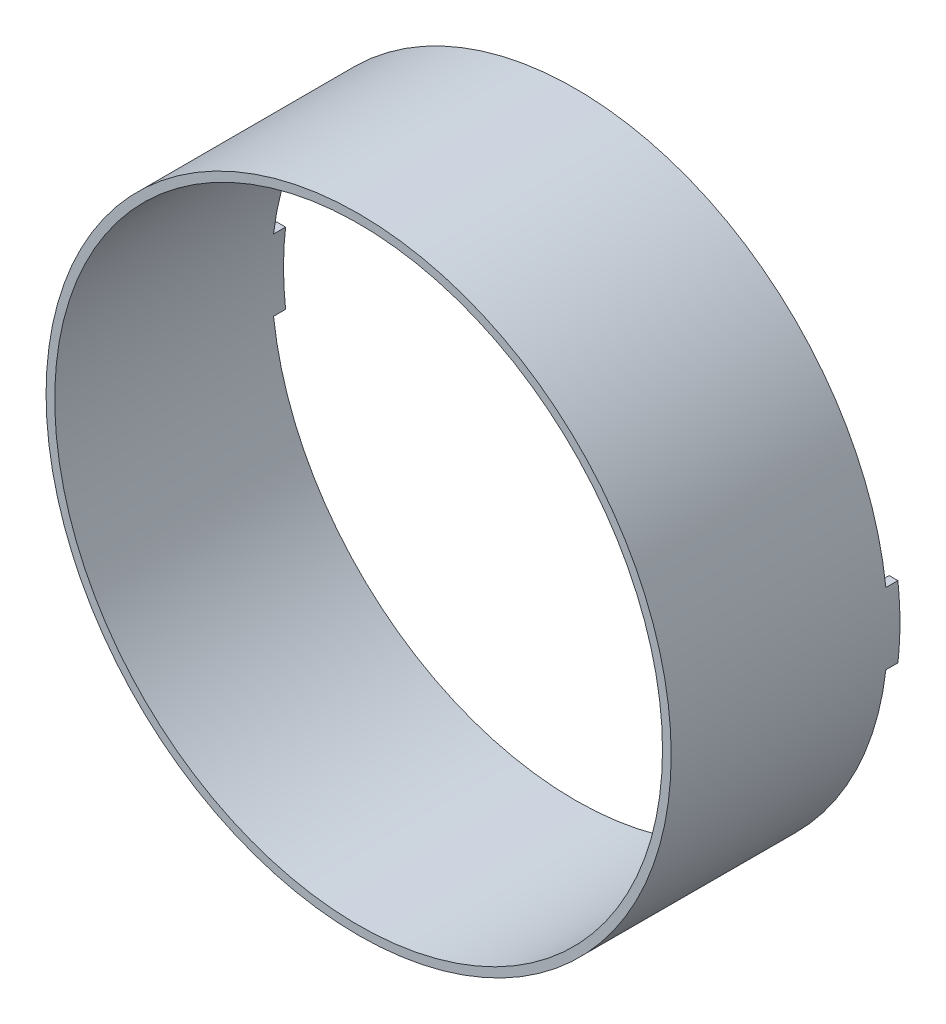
from build123d import *
from build123d.topology import SkipClean

# Parameters (mm, degrees)
BOSS_EXTRUDE1_DEPTH   = 2.5
BOSS_EXTRUDE1_2_DEPTH = 2.5
BOSS_EXTRUDE2_START   = 45
SKETCH3_R             = 64.9
SKETCH3_R_2           = 63.1
BOSS_EXTRUDE2_DEPTH   = 45


with BuildPart() as part:
    # Sketch1 → Boss-Extrude1 (new body)
    with BuildSketch(Plane.XY):
        with BuildLine():
            Line((-64.476739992, 31.755307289), (-62.664583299, 31.755307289))
            ThreePointArc((-62.664583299, 31.755307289), (-63.1, 39.155307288), (-62.664583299, 46.555307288))
            Line((-62.664583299, 46.555307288), (-64.476739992, 46.555307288))
            ThreePointArc((-64.476739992, 46.555307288), (-64.9, 39.155307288), (-64.476739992, 31.755307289))
        make_face()
    extrude(amount=-BOSS_EXTRUDE1_DEPTH)



with BuildPart() as body_2:
    # Sketch1 → Boss-Extrude1 2 (new body)
    with BuildSketch(Plane.XY):
        with BuildLine():
            Line((64.476739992, 46.555307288), (62.664583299, 46.555307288))
            ThreePointArc((62.664583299, 46.555307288), (63.1, 39.155307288), (62.664583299, 31.755307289))
            Line((62.664583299, 31.755307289), (64.476739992, 31.755307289))
            ThreePointArc((64.476739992, 31.755307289), (64.9, 39.155307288), (64.476739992, 46.555307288))
        make_face()
    extrude(amount=-BOSS_EXTRUDE1_2_DEPTH)


with BuildPart() as part_1:
    with SkipClean():  # the faces are left unmerged after this step: merging them gives an invalid solid
        add(part.part)

        add(body_2.part)  # Boss-Extrude2 merges body 2
        # Sketch3 → Boss-Extrude2 (add)
        with BuildSketch(Plane.XY.offset(BOSS_EXTRUDE2_START)):
            with Locations((0, 39.155307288)):
                Circle(SKETCH3_R)
            with Locations((0, 39.155307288)):
                Circle(SKETCH3_R_2, mode=Mode.SUBTRACT)
        extrude(amount=-BOSS_EXTRUDE2_DEPTH)


solid = part_1.part
